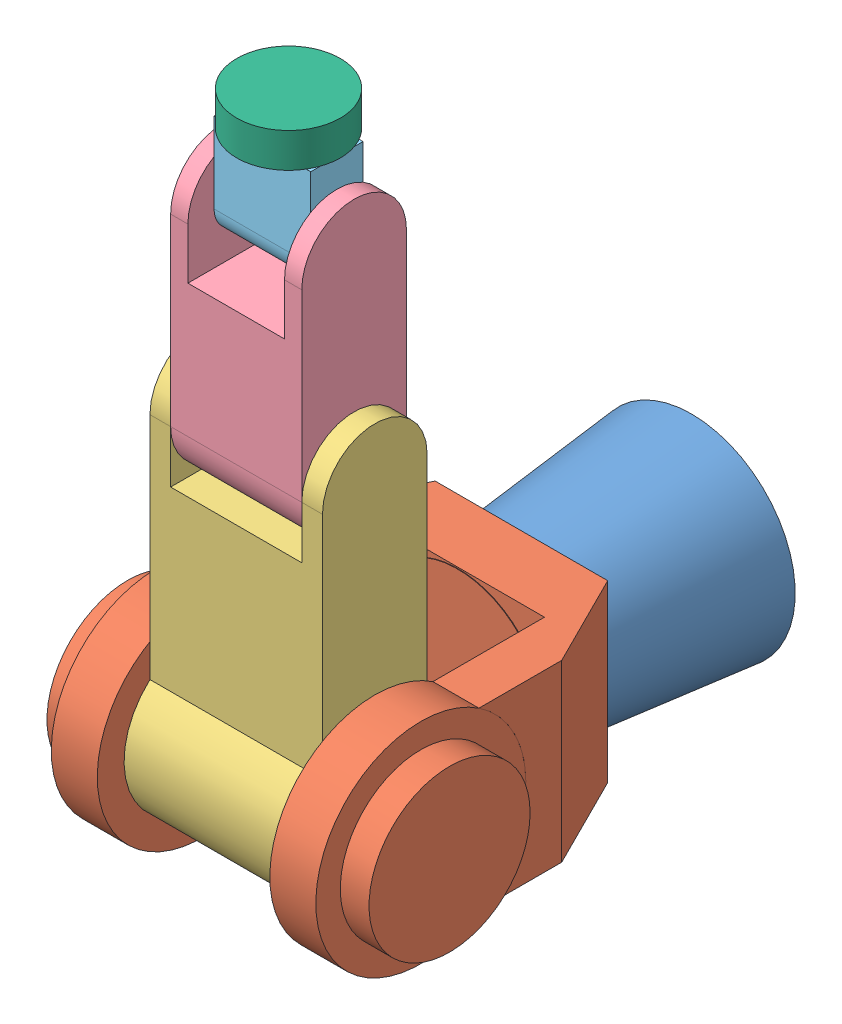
SolidWorks assembly Brazo5.SLDASM, configuration Default (file format 13000). Lengths in mm.
Overall size (280 601.76 441.77).
6 component instances, 6 part files, 10 mates.
Components (placement in the parent):
- Base-1: Base.SLDPRT [Default] x (-1 0 0) z (0 1 0) size (180 148 180)
- Soporte-1: Soporte.SLDPRT [Default] at (0 0 148) x (-1 0 0) z (0 1 0) size (280 293.77 182.52)
- Eslabon2-1: Eslabon2.SLDPRT [Default] at (75 0.0044 350.5132) x (0 1 0) z (1 0 0) size (363.5 136 150)
- Eslabon3-1: Eslabon3.SLDPRT [Default] at (-57 250.0044 350.5132) x (0 1 0) z (-1 0 0) size (251 91 114)
- Eslabon4-1: Eslabon4.SLDPRT [Default] at (42 410.0044 350.5132) x (0 1 0) z (1 0 0) size (93.25 45.5 84)
- Eslabon5-1: Eslabon5.SLDPRT [Default] at (0 510.5044 350.5132) x (0 -1 0) z (-0.99897 0 0.045365) size (30 90 90)
Mates (geometry in assembly coordinates):
- Coincident3: coincident anti-aligned: circle of Base-1; plane of Soporte-1 through (-75 76 148) normal (0 0 -1)
- Concentric1: concentric anti-aligned: circle of Base-1; cylinder of Soporte-1 through (0 0 203.5) axis (0 0 -1) radius 75
- Concentric3: concentric aligned: circle of Soporte-1; circle of Eslabon2-1
- Coincident5: coincident anti-aligned: plane of Soporte-1 through (-75 0.0044 350.5132) normal (1 0 0); plane of Eslabon2-1 through (-75 250.0044 350.5132) normal (-1 0 0)
- Coincident6: coincident anti-aligned: plane of Eslabon2-1 through (-57 295.5044 159.1468) normal (1 0 0); plane of Eslabon3-1 through (-57 250.0044 350.5132) normal (-1 0 0)
- Concentric4: concentric anti-aligned: circle of Eslabon2-1; circle of Eslabon3-1
- Coincident8: coincident anti-aligned: plane of Eslabon3-1 through (-42 455.5044 519.1229) normal (1 0 0); plane of Eslabon4-1 through (-42 410.0044 350.5132) normal (-1 0 0)
- Concentric5: concentric aligned: circle of Eslabon3-1; circle of Eslabon4-1
- Coincident9: coincident anti-aligned: plane of Eslabon4-1 through (0 480.5044 350.5132) normal (0 1 0); plane of Eslabon5-1 through (0 480.5044 350.5132) normal (0 -1 0)
- Concentric6: concentric anti-aligned: cylinder of Eslabon4-1 through (0 480.5044 350.5132) axis (0 -1 0) radius 22.75; cylinder of Eslabon5-1 through (0 480.5044 350.5132) axis (0 1 0) radius 45
